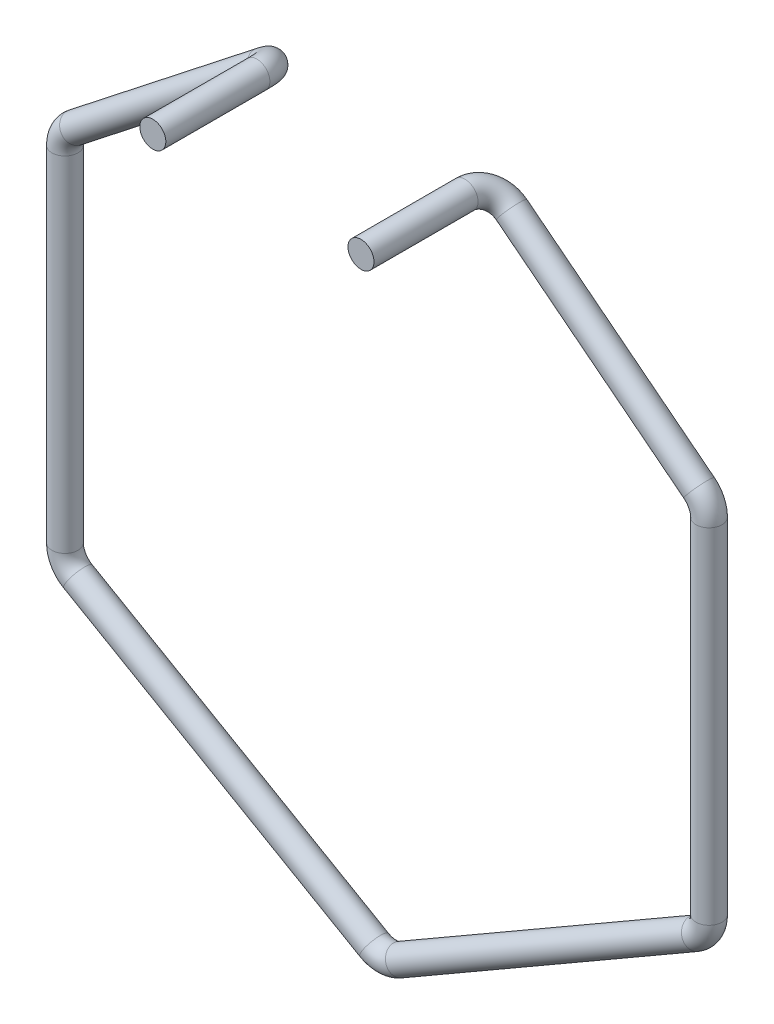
from build123d import *

# Parameters (mm, degrees)
ESQUISSE3_R = 3


with BuildPart() as part:
    # Base-Balayage: sweep along a curve in space
    with BuildLine() as base_balayage_path:
        Line((-24, 82.322916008, 6), (-24, 82.322916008, 30))
        ThreePointArc((-24, 82.322916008, 6), (-25.382423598, 81.237919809, 1.757359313), (-28.719889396, 78.618507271, 0))
        Line((-71.966087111, 44.676696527, 0), (-28.719889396, 78.618507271, 0))
        ThreePointArc((-71.966087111, 44.676696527, 0), (-73.65734573, 42.581073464, 0), (-74.261678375, 39.95680713, 0))
        Line((-74.261678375, -39.410898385, 0), (-74.261678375, 39.95680713, 0))
        ThreePointArc((-74.261678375, -39.410898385, 0), (-73.457830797, -42.410898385, 0), (-71.261678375, -44.607050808, 0))
        Line((-3, -84.017949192, 0), (-71.261678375, -44.607050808, 0))
        ThreePointArc((-3, -84.017949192, 0), (0, -84.82179677, 0), (3, -84.017949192, 0))
        Line((71.261678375, -44.607050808, 0), (3, -84.017949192, 0))
        ThreePointArc((71.261678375, -44.607050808, 0), (73.457830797, -42.410898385, 0), (74.261678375, -39.410898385, 0))
        Line((74.261678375, 39.95680713, 0), (74.261678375, -39.410898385, 0))
        ThreePointArc((74.261678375, 39.95680713, 0), (73.65734573, 42.581073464, 0), (71.966087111, 44.676696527, 0))
        Line((28.719889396, 78.618507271, 0), (71.966087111, 44.676696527, 0))
        ThreePointArc((24, 82.322916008, 6), (25.382423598, 81.237919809, 1.757359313), (28.719889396, 78.618507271, 0))
        Line((24, 82.322916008, 6), (24, 82.322916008, 30))
    # Esquisse3 → Base-Balayage (sweep)
    with BuildSketch(Plane.XY.offset(30)):
        with Locations((-24, 82.322916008)):
            Circle(ESQUISSE3_R)
    sweep(path=base_balayage_path.line)


solid = part.part
